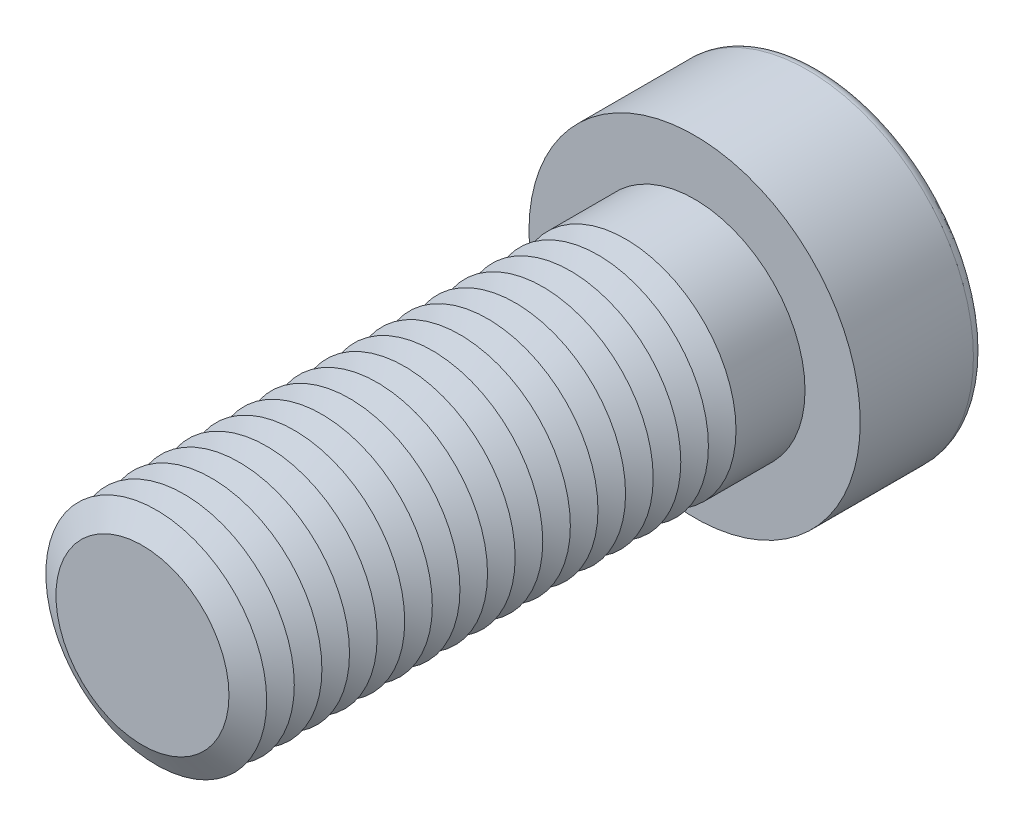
ISO-10303-21;
HEADER;
FILE_DESCRIPTION(('STEP AP214'),'2;1');
FILE_NAME('part.step','',(''),(''),'','','');
FILE_SCHEMA(('AUTOMOTIVE_DESIGN { 1 0 10303 214 1 1 1 1 }'));
ENDSEC;
DATA;
#1=APPLICATION_CONTEXT('core data for automotive mechanical design processes');
#2=APPLICATION_PROTOCOL_DEFINITION('international standard','automotive_design',2000,#1);
#3=PRODUCT_CONTEXT('',#1,'mechanical');
#4=PRODUCT('Part','Part','',(#3));
#5=PRODUCT_RELATED_PRODUCT_CATEGORY('part','',(#4));
#6=PRODUCT_DEFINITION_FORMATION('','',#4);
#7=PRODUCT_DEFINITION_CONTEXT('part definition',#1,'design');
#8=PRODUCT_DEFINITION('design','',#6,#7);
#9=PRODUCT_DEFINITION_SHAPE('','',#8);
#10=(LENGTH_UNIT() NAMED_UNIT(*) SI_UNIT(.MILLI.,.METRE.));
#11=(NAMED_UNIT(*) PLANE_ANGLE_UNIT() SI_UNIT($,.RADIAN.));
#12=(NAMED_UNIT(*) SI_UNIT($,.STERADIAN.) SOLID_ANGLE_UNIT());
#13=UNCERTAINTY_MEASURE_WITH_UNIT(LENGTH_MEASURE(1.E-05),#10,'distance_accuracy_value','');
#14=(GEOMETRIC_REPRESENTATION_CONTEXT(3) GLOBAL_UNCERTAINTY_ASSIGNED_CONTEXT((#13)) GLOBAL_UNIT_ASSIGNED_CONTEXT((#10,
#11,#12)) REPRESENTATION_CONTEXT('',''));
#15=CARTESIAN_POINT('',(0.,0.,0.));
#16=DIRECTION('',(0.,0.,1.));
#17=DIRECTION('',(1.,0.,0.));
#18=AXIS2_PLACEMENT_3D('',#15,#16,#17);
#19=CARTESIAN_POINT('',(0.,0.,33.));
#20=DIRECTION('',(0.,0.,1.));
#21=DIRECTION('',(1.,0.,0.));
#22=AXIS2_PLACEMENT_3D('',#19,#20,#21);
#23=CONICAL_SURFACE('',#22,8.,1.0471975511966);
#24=CARTESIAN_POINT('',(0.,0.,32.));
#25=DIRECTION('',(0.,0.,1.));
#26=DIRECTION('',(1.,0.,0.));
#27=AXIS2_PLACEMENT_3D('',#24,#25,#26);
#28=CIRCLE('',#27,6.26794919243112);
#29=CARTESIAN_POINT('',(6.26794919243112,0.,32.));
#30=VERTEX_POINT('',#29);
#31=EDGE_CURVE('E313',#30,#30,#28,.T.);
#32=ORIENTED_EDGE('',*,*,#31,.T.);
#33=EDGE_LOOP('',(#32));
#34=FACE_BOUND('',#33,.T.);
#35=CARTESIAN_POINT('',(0.,0.,33.));
#36=DIRECTION('',(0.,0.,1.));
#37=DIRECTION('',(1.,0.,0.));
#38=AXIS2_PLACEMENT_3D('',#35,#36,#37);
#39=CIRCLE('',#38,8.);
#40=CARTESIAN_POINT('',(8.,0.,33.));
#41=VERTEX_POINT('',#40);
#42=EDGE_CURVE('E316',#41,#41,#39,.T.);
#43=ORIENTED_EDGE('',*,*,#42,.F.);
#44=EDGE_LOOP('',(#43));
#45=FACE_BOUND('',#44,.T.);
#46=ADVANCED_FACE('F39',(#34,#45),#23,.T.);
#47=CARTESIAN_POINT('',(0.,0.,32.));
#48=DIRECTION('',(0.,0.,-1.));
#49=DIRECTION('',(-1.,0.,0.));
#50=AXIS2_PLACEMENT_3D('',#47,#48,#49);
#51=CONICAL_SURFACE('',#50,6.26794919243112,1.0471975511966);
#52=CARTESIAN_POINT('',(0.,0.,31.));
#53=DIRECTION('',(0.,0.,1.));
#54=DIRECTION('',(1.,0.,0.));
#55=AXIS2_PLACEMENT_3D('',#52,#53,#54);
#56=CIRCLE('',#55,8.);
#57=CARTESIAN_POINT('',(8.,0.,31.));
#58=VERTEX_POINT('',#57);
#59=EDGE_CURVE('E324',#58,#58,#56,.T.);
#60=ORIENTED_EDGE('',*,*,#59,.T.);
#61=EDGE_LOOP('',(#60));
#62=FACE_BOUND('',#61,.T.);
#63=ORIENTED_EDGE('',*,*,#31,.F.);
#64=EDGE_LOOP('',(#63));
#65=FACE_BOUND('',#64,.T.);
#66=ADVANCED_FACE('F245',(#62,#65),#51,.T.);
#67=CARTESIAN_POINT('',(0.,0.,40.));
#68=DIRECTION('',(0.,0.,1.));
#69=DIRECTION('',(1.,0.,0.));
#70=AXIS2_PLACEMENT_3D('',#67,#68,#69);
#71=PLANE('',#70);
#72=CARTESIAN_POINT('',(0.,0.,40.));
#73=DIRECTION('',(0.,0.,1.));
#74=DIRECTION('',(1.,0.,0.));
#75=AXIS2_PLACEMENT_3D('',#72,#73,#74);
#76=CIRCLE('',#75,6.26794919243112);
#77=CARTESIAN_POINT('',(6.26794919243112,0.,40.));
#78=VERTEX_POINT('',#77);
#79=EDGE_CURVE('E174',#78,#78,#76,.T.);
#80=ORIENTED_EDGE('',*,*,#79,.T.);
#81=EDGE_LOOP('',(#80));
#82=FACE_BOUND('',#81,.T.);
#83=ADVANCED_FACE('F251',(#82),#71,.T.);
#84=CARTESIAN_POINT('',(0.,0.,40.));
#85=DIRECTION('',(0.,0.,-1.));
#86=DIRECTION('',(-1.,0.,0.));
#87=AXIS2_PLACEMENT_3D('',#84,#85,#86);
#88=CONICAL_SURFACE('',#87,6.26794919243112,1.0471975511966);
#89=CARTESIAN_POINT('',(0.,0.,39.));
#90=DIRECTION('',(0.,0.,1.));
#91=DIRECTION('',(1.,0.,0.));
#92=AXIS2_PLACEMENT_3D('',#89,#90,#91);
#93=CIRCLE('',#92,8.);
#94=CARTESIAN_POINT('',(8.,0.,39.));
#95=VERTEX_POINT('',#94);
#96=EDGE_CURVE('E291',#95,#95,#93,.T.);
#97=ORIENTED_EDGE('',*,*,#96,.T.);
#98=EDGE_LOOP('',(#97));
#99=FACE_BOUND('',#98,.T.);
#100=ORIENTED_EDGE('',*,*,#79,.F.);
#101=EDGE_LOOP('',(#100));
#102=FACE_BOUND('',#101,.T.);
#103=ADVANCED_FACE('F199',(#99,#102),#88,.T.);
#104=CARTESIAN_POINT('',(0.,0.,39.));
#105=DIRECTION('',(0.,0.,1.));
#106=DIRECTION('',(1.,0.,0.));
#107=AXIS2_PLACEMENT_3D('',#104,#105,#106);
#108=CONICAL_SURFACE('',#107,8.,1.0471975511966);
#109=CARTESIAN_POINT('',(0.,0.,38.));
#110=DIRECTION('',(0.,0.,1.));
#111=DIRECTION('',(1.,0.,0.));
#112=AXIS2_PLACEMENT_3D('',#109,#110,#111);
#113=CIRCLE('',#112,6.26794919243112);
#114=CARTESIAN_POINT('',(6.26794919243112,0.,38.));
#115=VERTEX_POINT('',#114);
#116=EDGE_CURVE('E288',#115,#115,#113,.T.);
#117=ORIENTED_EDGE('',*,*,#116,.T.);
#118=EDGE_LOOP('',(#117));
#119=FACE_BOUND('',#118,.T.);
#120=ORIENTED_EDGE('',*,*,#96,.F.);
#121=EDGE_LOOP('',(#120));
#122=FACE_BOUND('',#121,.T.);
#123=ADVANCED_FACE('F277',(#119,#122),#108,.T.);
#124=CARTESIAN_POINT('',(0.,0.,38.));
#125=DIRECTION('',(0.,0.,-1.));
#126=DIRECTION('',(-1.,0.,0.));
#127=AXIS2_PLACEMENT_3D('',#124,#125,#126);
#128=CONICAL_SURFACE('',#127,6.26794919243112,1.0471975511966);
#129=CARTESIAN_POINT('',(0.,0.,37.));
#130=DIRECTION('',(0.,0.,1.));
#131=DIRECTION('',(1.,0.,0.));
#132=AXIS2_PLACEMENT_3D('',#129,#130,#131);
#133=CIRCLE('',#132,8.);
#134=CARTESIAN_POINT('',(8.,0.,37.));
#135=VERTEX_POINT('',#134);
#136=EDGE_CURVE('E299',#135,#135,#133,.T.);
#137=ORIENTED_EDGE('',*,*,#136,.T.);
#138=EDGE_LOOP('',(#137));
#139=FACE_BOUND('',#138,.T.);
#140=ORIENTED_EDGE('',*,*,#116,.F.);
#141=EDGE_LOOP('',(#140));
#142=FACE_BOUND('',#141,.T.);
#143=ADVANCED_FACE('F274',(#139,#142),#128,.T.);
#144=CARTESIAN_POINT('',(0.,0.,37.));
#145=DIRECTION('',(0.,0.,1.));
#146=DIRECTION('',(1.,0.,0.));
#147=AXIS2_PLACEMENT_3D('',#144,#145,#146);
#148=CONICAL_SURFACE('',#147,8.,1.0471975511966);
#149=CARTESIAN_POINT('',(0.,0.,36.));
#150=DIRECTION('',(0.,0.,1.));
#151=DIRECTION('',(1.,0.,0.));
#152=AXIS2_PLACEMENT_3D('',#149,#150,#151);
#153=CIRCLE('',#152,6.26794919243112);
#154=CARTESIAN_POINT('',(6.26794919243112,0.,36.));
#155=VERTEX_POINT('',#154);
#156=EDGE_CURVE('E293',#155,#155,#153,.T.);
#157=ORIENTED_EDGE('',*,*,#156,.T.);
#158=EDGE_LOOP('',(#157));
#159=FACE_BOUND('',#158,.T.);
#160=ORIENTED_EDGE('',*,*,#136,.F.);
#161=EDGE_LOOP('',(#160));
#162=FACE_BOUND('',#161,.T.);
#163=ADVANCED_FACE('F270',(#159,#162),#148,.T.);
#164=CARTESIAN_POINT('',(0.,0.,36.));
#165=DIRECTION('',(0.,0.,-1.));
#166=DIRECTION('',(-1.,0.,0.));
#167=AXIS2_PLACEMENT_3D('',#164,#165,#166);
#168=CONICAL_SURFACE('',#167,6.26794919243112,1.0471975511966);
#169=CARTESIAN_POINT('',(0.,0.,35.));
#170=DIRECTION('',(0.,0.,1.));
#171=DIRECTION('',(1.,0.,0.));
#172=AXIS2_PLACEMENT_3D('',#169,#170,#171);
#173=CIRCLE('',#172,8.);
#174=CARTESIAN_POINT('',(8.,0.,35.));
#175=VERTEX_POINT('',#174);
#176=EDGE_CURVE('E309',#175,#175,#173,.T.);
#177=ORIENTED_EDGE('',*,*,#176,.T.);
#178=EDGE_LOOP('',(#177));
#179=FACE_BOUND('',#178,.T.);
#180=ORIENTED_EDGE('',*,*,#156,.F.);
#181=EDGE_LOOP('',(#180));
#182=FACE_BOUND('',#181,.T.);
#183=ADVANCED_FACE('F266',(#179,#182),#168,.T.);
#184=CARTESIAN_POINT('',(0.,0.,35.));
#185=DIRECTION('',(0.,0.,1.));
#186=DIRECTION('',(1.,0.,0.));
#187=AXIS2_PLACEMENT_3D('',#184,#185,#186);
#188=CONICAL_SURFACE('',#187,8.,1.0471975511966);
#189=CARTESIAN_POINT('',(0.,0.,34.));
#190=DIRECTION('',(0.,0.,1.));
#191=DIRECTION('',(1.,0.,0.));
#192=AXIS2_PLACEMENT_3D('',#189,#190,#191);
#193=CIRCLE('',#192,6.26794919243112);
#194=CARTESIAN_POINT('',(6.26794919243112,0.,34.));
#195=VERTEX_POINT('',#194);
#196=EDGE_CURVE('E305',#195,#195,#193,.T.);
#197=ORIENTED_EDGE('',*,*,#196,.T.);
#198=EDGE_LOOP('',(#197));
#199=FACE_BOUND('',#198,.T.);
#200=ORIENTED_EDGE('',*,*,#176,.F.);
#201=EDGE_LOOP('',(#200));
#202=FACE_BOUND('',#201,.T.);
#203=ADVANCED_FACE('F262',(#199,#202),#188,.T.);
#204=CARTESIAN_POINT('',(0.,0.,34.));
#205=DIRECTION('',(0.,0.,-1.));
#206=DIRECTION('',(-1.,0.,0.));
#207=AXIS2_PLACEMENT_3D('',#204,#205,#206);
#208=CONICAL_SURFACE('',#207,6.26794919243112,1.0471975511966);
#209=ORIENTED_EDGE('',*,*,#42,.T.);
#210=EDGE_LOOP('',(#209));
#211=FACE_BOUND('',#210,.T.);
#212=ORIENTED_EDGE('',*,*,#196,.F.);
#213=EDGE_LOOP('',(#212));
#214=FACE_BOUND('',#213,.T.);
#215=ADVANCED_FACE('F258',(#211,#214),#208,.T.);
#216=CARTESIAN_POINT('',(0.,0.,31.));
#217=DIRECTION('',(0.,0.,1.));
#218=DIRECTION('',(1.,0.,0.));
#219=AXIS2_PLACEMENT_3D('',#216,#217,#218);
#220=CONICAL_SURFACE('',#219,8.,1.0471975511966);
#221=CARTESIAN_POINT('',(0.,0.,30.));
#222=DIRECTION('',(0.,0.,1.));
#223=DIRECTION('',(1.,0.,0.));
#224=AXIS2_PLACEMENT_3D('',#221,#222,#223);
#225=CIRCLE('',#224,6.26794919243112);
#226=CARTESIAN_POINT('',(6.26794919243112,0.,30.));
#227=VERTEX_POINT('',#226);
#228=EDGE_CURVE('E320',#227,#227,#225,.T.);
#229=ORIENTED_EDGE('',*,*,#228,.T.);
#230=EDGE_LOOP('',(#229));
#231=FACE_BOUND('',#230,.T.);
#232=ORIENTED_EDGE('',*,*,#59,.F.);
#233=EDGE_LOOP('',(#232));
#234=FACE_BOUND('',#233,.T.);
#235=ADVANCED_FACE('F261',(#231,#234),#220,.T.);
#236=CARTESIAN_POINT('',(0.,0.,30.));
#237=DIRECTION('',(0.,0.,-1.));
#238=DIRECTION('',(-1.,0.,0.));
#239=AXIS2_PLACEMENT_3D('',#236,#237,#238);
#240=CONICAL_SURFACE('',#239,6.26794919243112,1.0471975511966);
#241=CARTESIAN_POINT('',(0.,0.,29.));
#242=DIRECTION('',(0.,0.,1.));
#243=DIRECTION('',(1.,0.,0.));
#244=AXIS2_PLACEMENT_3D('',#241,#242,#243);
#245=CIRCLE('',#244,8.);
#246=CARTESIAN_POINT('',(8.,0.,29.));
#247=VERTEX_POINT('',#246);
#248=EDGE_CURVE('E332',#247,#247,#245,.T.);
#249=ORIENTED_EDGE('',*,*,#248,.T.);
#250=EDGE_LOOP('',(#249));
#251=FACE_BOUND('',#250,.T.);
#252=ORIENTED_EDGE('',*,*,#228,.F.);
#253=EDGE_LOOP('',(#252));
#254=FACE_BOUND('',#253,.T.);
#255=ADVANCED_FACE('F527',(#251,#254),#240,.T.);
#256=CARTESIAN_POINT('',(0.,0.,29.));
#257=DIRECTION('',(0.,0.,1.));
#258=DIRECTION('',(1.,0.,0.));
#259=AXIS2_PLACEMENT_3D('',#256,#257,#258);
#260=CONICAL_SURFACE('',#259,8.,1.0471975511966);
#261=CARTESIAN_POINT('',(0.,0.,28.));
#262=DIRECTION('',(0.,0.,1.));
#263=DIRECTION('',(1.,0.,0.));
#264=AXIS2_PLACEMENT_3D('',#261,#262,#263);
#265=CIRCLE('',#264,6.26794919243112);
#266=CARTESIAN_POINT('',(6.26794919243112,0.,28.));
#267=VERTEX_POINT('',#266);
#268=EDGE_CURVE('E328',#267,#267,#265,.T.);
#269=ORIENTED_EDGE('',*,*,#268,.T.);
#270=EDGE_LOOP('',(#269));
#271=FACE_BOUND('',#270,.T.);
#272=ORIENTED_EDGE('',*,*,#248,.F.);
#273=EDGE_LOOP('',(#272));
#274=FACE_BOUND('',#273,.T.);
#275=ADVANCED_FACE('F523',(#271,#274),#260,.T.);
#276=CARTESIAN_POINT('',(0.,0.,28.));
#277=DIRECTION('',(0.,0.,-1.));
#278=DIRECTION('',(-1.,0.,0.));
#279=AXIS2_PLACEMENT_3D('',#276,#277,#278);
#280=CONICAL_SURFACE('',#279,6.26794919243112,1.0471975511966);
#281=CARTESIAN_POINT('',(0.,0.,27.));
#282=DIRECTION('',(0.,0.,1.));
#283=DIRECTION('',(1.,0.,0.));
#284=AXIS2_PLACEMENT_3D('',#281,#282,#283);
#285=CIRCLE('',#284,8.);
#286=CARTESIAN_POINT('',(8.,0.,27.));
#287=VERTEX_POINT('',#286);
#288=EDGE_CURVE('E339',#287,#287,#285,.T.);
#289=ORIENTED_EDGE('',*,*,#288,.T.);
#290=EDGE_LOOP('',(#289));
#291=FACE_BOUND('',#290,.T.);
#292=ORIENTED_EDGE('',*,*,#268,.F.);
#293=EDGE_LOOP('',(#292));
#294=FACE_BOUND('',#293,.T.);
#295=ADVANCED_FACE('F519',(#291,#294),#280,.T.);
#296=CARTESIAN_POINT('',(0.,0.,27.));
#297=DIRECTION('',(0.,0.,1.));
#298=DIRECTION('',(1.,0.,0.));
#299=AXIS2_PLACEMENT_3D('',#296,#297,#298);
#300=CONICAL_SURFACE('',#299,8.,1.0471975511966);
#301=CARTESIAN_POINT('',(0.,0.,26.));
#302=DIRECTION('',(0.,0.,1.));
#303=DIRECTION('',(1.,0.,0.));
#304=AXIS2_PLACEMENT_3D('',#301,#302,#303);
#305=CIRCLE('',#304,6.26794919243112);
#306=CARTESIAN_POINT('',(6.26794919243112,0.,26.));
#307=VERTEX_POINT('',#306);
#308=EDGE_CURVE('E336',#307,#307,#305,.T.);
#309=ORIENTED_EDGE('',*,*,#308,.T.);
#310=EDGE_LOOP('',(#309));
#311=FACE_BOUND('',#310,.T.);
#312=ORIENTED_EDGE('',*,*,#288,.F.);
#313=EDGE_LOOP('',(#312));
#314=FACE_BOUND('',#313,.T.);
#315=ADVANCED_FACE('F515',(#311,#314),#300,.T.);
#316=CARTESIAN_POINT('',(0.,0.,26.));
#317=DIRECTION('',(0.,0.,-1.));
#318=DIRECTION('',(-1.,0.,0.));
#319=AXIS2_PLACEMENT_3D('',#316,#317,#318);
#320=CONICAL_SURFACE('',#319,6.26794919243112,1.0471975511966);
#321=CARTESIAN_POINT('',(0.,0.,25.));
#322=DIRECTION('',(0.,0.,1.));
#323=DIRECTION('',(1.,0.,0.));
#324=AXIS2_PLACEMENT_3D('',#321,#322,#323);
#325=CIRCLE('',#324,8.);
#326=CARTESIAN_POINT('',(8.,0.,25.));
#327=VERTEX_POINT('',#326);
#328=EDGE_CURVE('E347',#327,#327,#325,.T.);
#329=ORIENTED_EDGE('',*,*,#328,.T.);
#330=EDGE_LOOP('',(#329));
#331=FACE_BOUND('',#330,.T.);
#332=ORIENTED_EDGE('',*,*,#308,.F.);
#333=EDGE_LOOP('',(#332));
#334=FACE_BOUND('',#333,.T.);
#335=ADVANCED_FACE('F511',(#331,#334),#320,.T.);
#336=CARTESIAN_POINT('',(0.,0.,25.));
#337=DIRECTION('',(0.,0.,1.));
#338=DIRECTION('',(1.,0.,0.));
#339=AXIS2_PLACEMENT_3D('',#336,#337,#338);
#340=CONICAL_SURFACE('',#339,8.,1.0471975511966);
#341=CARTESIAN_POINT('',(0.,0.,24.));
#342=DIRECTION('',(0.,0.,1.));
#343=DIRECTION('',(1.,0.,0.));
#344=AXIS2_PLACEMENT_3D('',#341,#342,#343);
#345=CIRCLE('',#344,6.26794919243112);
#346=CARTESIAN_POINT('',(6.26794919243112,0.,24.));
#347=VERTEX_POINT('',#346);
#348=EDGE_CURVE('E343',#347,#347,#345,.T.);
#349=ORIENTED_EDGE('',*,*,#348,.T.);
#350=EDGE_LOOP('',(#349));
#351=FACE_BOUND('',#350,.T.);
#352=ORIENTED_EDGE('',*,*,#328,.F.);
#353=EDGE_LOOP('',(#352));
#354=FACE_BOUND('',#353,.T.);
#355=ADVANCED_FACE('F507',(#351,#354),#340,.T.);
#356=CARTESIAN_POINT('',(0.,0.,24.));
#357=DIRECTION('',(0.,0.,-1.));
#358=DIRECTION('',(-1.,0.,0.));
#359=AXIS2_PLACEMENT_3D('',#356,#357,#358);
#360=CONICAL_SURFACE('',#359,6.26794919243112,1.0471975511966);
#361=CARTESIAN_POINT('',(0.,0.,23.));
#362=DIRECTION('',(0.,0.,1.));
#363=DIRECTION('',(1.,0.,0.));
#364=AXIS2_PLACEMENT_3D('',#361,#362,#363);
#365=CIRCLE('',#364,8.);
#366=CARTESIAN_POINT('',(8.,0.,23.));
#367=VERTEX_POINT('',#366);
#368=EDGE_CURVE('E355',#367,#367,#365,.T.);
#369=ORIENTED_EDGE('',*,*,#368,.T.);
#370=EDGE_LOOP('',(#369));
#371=FACE_BOUND('',#370,.T.);
#372=ORIENTED_EDGE('',*,*,#348,.F.);
#373=EDGE_LOOP('',(#372));
#374=FACE_BOUND('',#373,.T.);
#375=ADVANCED_FACE('F503',(#371,#374),#360,.T.);
#376=CARTESIAN_POINT('',(0.,0.,23.));
#377=DIRECTION('',(0.,0.,1.));
#378=DIRECTION('',(1.,0.,0.));
#379=AXIS2_PLACEMENT_3D('',#376,#377,#378);
#380=CONICAL_SURFACE('',#379,8.,1.0471975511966);
#381=CARTESIAN_POINT('',(0.,0.,22.));
#382=DIRECTION('',(0.,0.,1.));
#383=DIRECTION('',(1.,0.,0.));
#384=AXIS2_PLACEMENT_3D('',#381,#382,#383);
#385=CIRCLE('',#384,6.26794919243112);
#386=CARTESIAN_POINT('',(6.26794919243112,0.,22.));
#387=VERTEX_POINT('',#386);
#388=EDGE_CURVE('E351',#387,#387,#385,.T.);
#389=ORIENTED_EDGE('',*,*,#388,.T.);
#390=EDGE_LOOP('',(#389));
#391=FACE_BOUND('',#390,.T.);
#392=ORIENTED_EDGE('',*,*,#368,.F.);
#393=EDGE_LOOP('',(#392));
#394=FACE_BOUND('',#393,.T.);
#395=ADVANCED_FACE('F499',(#391,#394),#380,.T.);
#396=CARTESIAN_POINT('',(0.,0.,22.));
#397=DIRECTION('',(0.,0.,-1.));
#398=DIRECTION('',(-1.,0.,0.));
#399=AXIS2_PLACEMENT_3D('',#396,#397,#398);
#400=CONICAL_SURFACE('',#399,6.26794919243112,1.0471975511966);
#401=CARTESIAN_POINT('',(0.,0.,21.));
#402=DIRECTION('',(0.,0.,1.));
#403=DIRECTION('',(1.,0.,0.));
#404=AXIS2_PLACEMENT_3D('',#401,#402,#403);
#405=CIRCLE('',#404,8.);
#406=CARTESIAN_POINT('',(8.,0.,21.));
#407=VERTEX_POINT('',#406);
#408=EDGE_CURVE('E363',#407,#407,#405,.T.);
#409=ORIENTED_EDGE('',*,*,#408,.T.);
#410=EDGE_LOOP('',(#409));
#411=FACE_BOUND('',#410,.T.);
#412=ORIENTED_EDGE('',*,*,#388,.F.);
#413=EDGE_LOOP('',(#412));
#414=FACE_BOUND('',#413,.T.);
#415=ADVANCED_FACE('F495',(#411,#414),#400,.T.);
#416=CARTESIAN_POINT('',(0.,0.,21.));
#417=DIRECTION('',(0.,0.,1.));
#418=DIRECTION('',(1.,0.,0.));
#419=AXIS2_PLACEMENT_3D('',#416,#417,#418);
#420=CONICAL_SURFACE('',#419,8.,1.0471975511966);
#421=CARTESIAN_POINT('',(0.,0.,20.));
#422=DIRECTION('',(0.,0.,1.));
#423=DIRECTION('',(1.,0.,0.));
#424=AXIS2_PLACEMENT_3D('',#421,#422,#423);
#425=CIRCLE('',#424,6.26794919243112);
#426=CARTESIAN_POINT('',(6.26794919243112,0.,20.));
#427=VERTEX_POINT('',#426);
#428=EDGE_CURVE('E359',#427,#427,#425,.T.);
#429=ORIENTED_EDGE('',*,*,#428,.T.);
#430=EDGE_LOOP('',(#429));
#431=FACE_BOUND('',#430,.T.);
#432=ORIENTED_EDGE('',*,*,#408,.F.);
#433=EDGE_LOOP('',(#432));
#434=FACE_BOUND('',#433,.T.);
#435=ADVANCED_FACE('F491',(#431,#434),#420,.T.);
#436=CARTESIAN_POINT('',(0.,0.,20.));
#437=DIRECTION('',(0.,0.,-1.));
#438=DIRECTION('',(-1.,0.,0.));
#439=AXIS2_PLACEMENT_3D('',#436,#437,#438);
#440=CONICAL_SURFACE('',#439,6.26794919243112,1.0471975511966);
#441=CARTESIAN_POINT('',(0.,0.,19.));
#442=DIRECTION('',(0.,0.,1.));
#443=DIRECTION('',(1.,0.,0.));
#444=AXIS2_PLACEMENT_3D('',#441,#442,#443);
#445=CIRCLE('',#444,8.);
#446=CARTESIAN_POINT('',(8.,0.,19.));
#447=VERTEX_POINT('',#446);
#448=EDGE_CURVE('E371',#447,#447,#445,.T.);
#449=ORIENTED_EDGE('',*,*,#448,.T.);
#450=EDGE_LOOP('',(#449));
#451=FACE_BOUND('',#450,.T.);
#452=ORIENTED_EDGE('',*,*,#428,.F.);
#453=EDGE_LOOP('',(#452));
#454=FACE_BOUND('',#453,.T.);
#455=ADVANCED_FACE('F487',(#451,#454),#440,.T.);
#456=CARTESIAN_POINT('',(0.,0.,19.));
#457=DIRECTION('',(0.,0.,1.));
#458=DIRECTION('',(1.,0.,0.));
#459=AXIS2_PLACEMENT_3D('',#456,#457,#458);
#460=CONICAL_SURFACE('',#459,8.,1.0471975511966);
#461=CARTESIAN_POINT('',(0.,0.,18.));
#462=DIRECTION('',(0.,0.,1.));
#463=DIRECTION('',(1.,0.,0.));
#464=AXIS2_PLACEMENT_3D('',#461,#462,#463);
#465=CIRCLE('',#464,6.26794919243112);
#466=CARTESIAN_POINT('',(6.26794919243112,0.,18.));
#467=VERTEX_POINT('',#466);
#468=EDGE_CURVE('E367',#467,#467,#465,.T.);
#469=ORIENTED_EDGE('',*,*,#468,.T.);
#470=EDGE_LOOP('',(#469));
#471=FACE_BOUND('',#470,.T.);
#472=ORIENTED_EDGE('',*,*,#448,.F.);
#473=EDGE_LOOP('',(#472));
#474=FACE_BOUND('',#473,.T.);
#475=ADVANCED_FACE('F483',(#471,#474),#460,.T.);
#476=CARTESIAN_POINT('',(0.,0.,18.));
#477=DIRECTION('',(0.,0.,-1.));
#478=DIRECTION('',(-1.,0.,0.));
#479=AXIS2_PLACEMENT_3D('',#476,#477,#478);
#480=CONICAL_SURFACE('',#479,6.26794919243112,1.0471975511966);
#481=CARTESIAN_POINT('',(0.,0.,17.));
#482=DIRECTION('',(0.,0.,1.));
#483=DIRECTION('',(1.,0.,0.));
#484=AXIS2_PLACEMENT_3D('',#481,#482,#483);
#485=CIRCLE('',#484,8.);
#486=CARTESIAN_POINT('',(8.,0.,17.));
#487=VERTEX_POINT('',#486);
#488=EDGE_CURVE('E379',#487,#487,#485,.T.);
#489=ORIENTED_EDGE('',*,*,#488,.T.);
#490=EDGE_LOOP('',(#489));
#491=FACE_BOUND('',#490,.T.);
#492=ORIENTED_EDGE('',*,*,#468,.F.);
#493=EDGE_LOOP('',(#492));
#494=FACE_BOUND('',#493,.T.);
#495=ADVANCED_FACE('F479',(#491,#494),#480,.T.);
#496=CARTESIAN_POINT('',(0.,0.,17.));
#497=DIRECTION('',(0.,0.,1.));
#498=DIRECTION('',(1.,0.,0.));
#499=AXIS2_PLACEMENT_3D('',#496,#497,#498);
#500=CONICAL_SURFACE('',#499,8.,1.0471975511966);
#501=CARTESIAN_POINT('',(0.,0.,16.));
#502=DIRECTION('',(0.,0.,1.));
#503=DIRECTION('',(1.,0.,0.));
#504=AXIS2_PLACEMENT_3D('',#501,#502,#503);
#505=CIRCLE('',#504,6.26794919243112);
#506=CARTESIAN_POINT('',(6.26794919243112,0.,16.));
#507=VERTEX_POINT('',#506);
#508=EDGE_CURVE('E375',#507,#507,#505,.T.);
#509=ORIENTED_EDGE('',*,*,#508,.T.);
#510=EDGE_LOOP('',(#509));
#511=FACE_BOUND('',#510,.T.);
#512=ORIENTED_EDGE('',*,*,#488,.F.);
#513=EDGE_LOOP('',(#512));
#514=FACE_BOUND('',#513,.T.);
#515=ADVANCED_FACE('F475',(#511,#514),#500,.T.);
#516=CARTESIAN_POINT('',(0.,0.,16.));
#517=DIRECTION('',(0.,0.,-1.));
#518=DIRECTION('',(-1.,0.,0.));
#519=AXIS2_PLACEMENT_3D('',#516,#517,#518);
#520=CONICAL_SURFACE('',#519,6.26794919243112,1.0471975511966);
#521=CARTESIAN_POINT('',(0.,0.,15.));
#522=DIRECTION('',(0.,0.,1.));
#523=DIRECTION('',(1.,0.,0.));
#524=AXIS2_PLACEMENT_3D('',#521,#522,#523);
#525=CIRCLE('',#524,8.);
#526=CARTESIAN_POINT('',(8.,0.,15.));
#527=VERTEX_POINT('',#526);
#528=EDGE_CURVE('E387',#527,#527,#525,.T.);
#529=ORIENTED_EDGE('',*,*,#528,.T.);
#530=EDGE_LOOP('',(#529));
#531=FACE_BOUND('',#530,.T.);
#532=ORIENTED_EDGE('',*,*,#508,.F.);
#533=EDGE_LOOP('',(#532));
#534=FACE_BOUND('',#533,.T.);
#535=ADVANCED_FACE('F471',(#531,#534),#520,.T.);
#536=CARTESIAN_POINT('',(0.,0.,15.));
#537=DIRECTION('',(0.,0.,1.));
#538=DIRECTION('',(1.,0.,0.));
#539=AXIS2_PLACEMENT_3D('',#536,#537,#538);
#540=CONICAL_SURFACE('',#539,8.,1.0471975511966);
#541=CARTESIAN_POINT('',(0.,0.,14.));
#542=DIRECTION('',(0.,0.,1.));
#543=DIRECTION('',(1.,0.,0.));
#544=AXIS2_PLACEMENT_3D('',#541,#542,#543);
#545=CIRCLE('',#544,6.26794919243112);
#546=CARTESIAN_POINT('',(6.26794919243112,0.,14.));
#547=VERTEX_POINT('',#546);
#548=EDGE_CURVE('E383',#547,#547,#545,.T.);
#549=ORIENTED_EDGE('',*,*,#548,.T.);
#550=EDGE_LOOP('',(#549));
#551=FACE_BOUND('',#550,.T.);
#552=ORIENTED_EDGE('',*,*,#528,.F.);
#553=EDGE_LOOP('',(#552));
#554=FACE_BOUND('',#553,.T.);
#555=ADVANCED_FACE('F467',(#551,#554),#540,.T.);
#556=CARTESIAN_POINT('',(0.,0.,14.));
#557=DIRECTION('',(0.,0.,-1.));
#558=DIRECTION('',(-1.,0.,0.));
#559=AXIS2_PLACEMENT_3D('',#556,#557,#558);
#560=CONICAL_SURFACE('',#559,6.26794919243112,1.0471975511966);
#561=CARTESIAN_POINT('',(0.,0.,13.));
#562=DIRECTION('',(0.,0.,1.));
#563=DIRECTION('',(1.,0.,0.));
#564=AXIS2_PLACEMENT_3D('',#561,#562,#563);
#565=CIRCLE('',#564,8.);
#566=CARTESIAN_POINT('',(8.,0.,13.));
#567=VERTEX_POINT('',#566);
#568=EDGE_CURVE('E395',#567,#567,#565,.T.);
#569=ORIENTED_EDGE('',*,*,#568,.T.);
#570=EDGE_LOOP('',(#569));
#571=FACE_BOUND('',#570,.T.);
#572=ORIENTED_EDGE('',*,*,#548,.F.);
#573=EDGE_LOOP('',(#572));
#574=FACE_BOUND('',#573,.T.);
#575=ADVANCED_FACE('F463',(#571,#574),#560,.T.);
#576=CARTESIAN_POINT('',(0.,0.,13.));
#577=DIRECTION('',(0.,0.,1.));
#578=DIRECTION('',(1.,0.,0.));
#579=AXIS2_PLACEMENT_3D('',#576,#577,#578);
#580=CONICAL_SURFACE('',#579,8.,1.0471975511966);
#581=CARTESIAN_POINT('',(0.,0.,12.));
#582=DIRECTION('',(0.,0.,1.));
#583=DIRECTION('',(1.,0.,0.));
#584=AXIS2_PLACEMENT_3D('',#581,#582,#583);
#585=CIRCLE('',#584,6.26794919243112);
#586=CARTESIAN_POINT('',(6.26794919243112,0.,12.));
#587=VERTEX_POINT('',#586);
#588=EDGE_CURVE('E391',#587,#587,#585,.T.);
#589=ORIENTED_EDGE('',*,*,#588,.T.);
#590=EDGE_LOOP('',(#589));
#591=FACE_BOUND('',#590,.T.);
#592=ORIENTED_EDGE('',*,*,#568,.F.);
#593=EDGE_LOOP('',(#592));
#594=FACE_BOUND('',#593,.T.);
#595=ADVANCED_FACE('F459',(#591,#594),#580,.T.);
#596=CARTESIAN_POINT('',(0.,0.,12.));
#597=DIRECTION('',(0.,0.,-1.));
#598=DIRECTION('',(-1.,0.,0.));
#599=AXIS2_PLACEMENT_3D('',#596,#597,#598);
#600=CONICAL_SURFACE('',#599,6.26794919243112,1.0471975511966);
#601=CARTESIAN_POINT('',(0.,0.,11.));
#602=DIRECTION('',(0.,0.,1.));
#603=DIRECTION('',(1.,0.,0.));
#604=AXIS2_PLACEMENT_3D('',#601,#602,#603);
#605=CIRCLE('',#604,8.);
#606=CARTESIAN_POINT('',(8.,0.,11.));
#607=VERTEX_POINT('',#606);
#608=EDGE_CURVE('E403',#607,#607,#605,.T.);
#609=ORIENTED_EDGE('',*,*,#608,.T.);
#610=EDGE_LOOP('',(#609));
#611=FACE_BOUND('',#610,.T.);
#612=ORIENTED_EDGE('',*,*,#588,.F.);
#613=EDGE_LOOP('',(#612));
#614=FACE_BOUND('',#613,.T.);
#615=ADVANCED_FACE('F455',(#611,#614),#600,.T.);
#616=CARTESIAN_POINT('',(0.,0.,11.));
#617=DIRECTION('',(0.,0.,1.));
#618=DIRECTION('',(1.,0.,0.));
#619=AXIS2_PLACEMENT_3D('',#616,#617,#618);
#620=CONICAL_SURFACE('',#619,8.,1.0471975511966);
#621=CARTESIAN_POINT('',(0.,0.,10.));
#622=DIRECTION('',(0.,0.,1.));
#623=DIRECTION('',(1.,0.,0.));
#624=AXIS2_PLACEMENT_3D('',#621,#622,#623);
#625=CIRCLE('',#624,6.26794919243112);
#626=CARTESIAN_POINT('',(6.26794919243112,0.,10.));
#627=VERTEX_POINT('',#626);
#628=EDGE_CURVE('E399',#627,#627,#625,.T.);
#629=ORIENTED_EDGE('',*,*,#628,.T.);
#630=EDGE_LOOP('',(#629));
#631=FACE_BOUND('',#630,.T.);
#632=ORIENTED_EDGE('',*,*,#608,.F.);
#633=EDGE_LOOP('',(#632));
#634=FACE_BOUND('',#633,.T.);
#635=ADVANCED_FACE('F451',(#631,#634),#620,.T.);
#636=CARTESIAN_POINT('',(0.,0.,10.));
#637=DIRECTION('',(0.,0.,-1.));
#638=DIRECTION('',(-1.,0.,0.));
#639=AXIS2_PLACEMENT_3D('',#636,#637,#638);
#640=CONICAL_SURFACE('',#639,6.26794919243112,1.0471975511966);
#641=CARTESIAN_POINT('',(0.,0.,9.));
#642=DIRECTION('',(0.,0.,1.));
#643=DIRECTION('',(1.,0.,0.));
#644=AXIS2_PLACEMENT_3D('',#641,#642,#643);
#645=CIRCLE('',#644,8.);
#646=CARTESIAN_POINT('',(8.,0.,9.));
#647=VERTEX_POINT('',#646);
#648=EDGE_CURVE('E411',#647,#647,#645,.T.);
#649=ORIENTED_EDGE('',*,*,#648,.T.);
#650=EDGE_LOOP('',(#649));
#651=FACE_BOUND('',#650,.T.);
#652=ORIENTED_EDGE('',*,*,#628,.F.);
#653=EDGE_LOOP('',(#652));
#654=FACE_BOUND('',#653,.T.);
#655=ADVANCED_FACE('F447',(#651,#654),#640,.T.);
#656=CARTESIAN_POINT('',(0.,0.,9.));
#657=DIRECTION('',(0.,0.,1.));
#658=DIRECTION('',(1.,0.,0.));
#659=AXIS2_PLACEMENT_3D('',#656,#657,#658);
#660=CONICAL_SURFACE('',#659,8.,1.0471975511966);
#661=CARTESIAN_POINT('',(0.,0.,8.));
#662=DIRECTION('',(0.,0.,1.));
#663=DIRECTION('',(1.,0.,0.));
#664=AXIS2_PLACEMENT_3D('',#661,#662,#663);
#665=CIRCLE('',#664,6.26794919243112);
#666=CARTESIAN_POINT('',(6.26794919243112,0.,8.));
#667=VERTEX_POINT('',#666);
#668=EDGE_CURVE('E407',#667,#667,#665,.T.);
#669=ORIENTED_EDGE('',*,*,#668,.T.);
#670=EDGE_LOOP('',(#669));
#671=FACE_BOUND('',#670,.T.);
#672=ORIENTED_EDGE('',*,*,#648,.F.);
#673=EDGE_LOOP('',(#672));
#674=FACE_BOUND('',#673,.T.);
#675=ADVANCED_FACE('F442',(#671,#674),#660,.T.);
#676=CARTESIAN_POINT('',(0.,0.,8.));
#677=DIRECTION('',(0.,0.,-1.));
#678=DIRECTION('',(-1.,0.,0.));
#679=AXIS2_PLACEMENT_3D('',#676,#677,#678);
#680=CONICAL_SURFACE('',#679,6.26794919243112,1.0471975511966);
#681=CARTESIAN_POINT('',(0.,0.,7.));
#682=DIRECTION('',(0.,0.,1.));
#683=DIRECTION('',(1.,0.,0.));
#684=AXIS2_PLACEMENT_3D('',#681,#682,#683);
#685=CIRCLE('',#684,8.);
#686=CARTESIAN_POINT('',(8.,0.,7.));
#687=VERTEX_POINT('',#686);
#688=EDGE_CURVE('E423',#687,#687,#685,.T.);
#689=ORIENTED_EDGE('',*,*,#688,.T.);
#690=EDGE_LOOP('',(#689));
#691=FACE_BOUND('',#690,.T.);
#692=ORIENTED_EDGE('',*,*,#668,.F.);
#693=EDGE_LOOP('',(#692));
#694=FACE_BOUND('',#693,.T.);
#695=ADVANCED_FACE('F428',(#691,#694),#680,.T.);
#696=CARTESIAN_POINT('',(0.,0.,7.));
#697=DIRECTION('',(0.,0.,1.));
#698=DIRECTION('',(1.,0.,0.));
#699=AXIS2_PLACEMENT_3D('',#696,#697,#698);
#700=CONICAL_SURFACE('',#699,8.,1.0471975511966);
#701=CARTESIAN_POINT('',(0.,0.,6.));
#702=DIRECTION('',(0.,0.,1.));
#703=DIRECTION('',(1.,0.,0.));
#704=AXIS2_PLACEMENT_3D('',#701,#702,#703);
#705=CIRCLE('',#704,6.26794919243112);
#706=CARTESIAN_POINT('',(6.26794919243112,0.,6.));
#707=VERTEX_POINT('',#706);
#708=EDGE_CURVE('E415',#707,#707,#705,.T.);
#709=ORIENTED_EDGE('',*,*,#708,.T.);
#710=EDGE_LOOP('',(#709));
#711=FACE_BOUND('',#710,.T.);
#712=ORIENTED_EDGE('',*,*,#688,.F.);
#713=EDGE_LOOP('',(#712));
#714=FACE_BOUND('',#713,.T.);
#715=ADVANCED_FACE('F431',(#711,#714),#700,.T.);
#716=CARTESIAN_POINT('',(0.,0.,6.));
#717=DIRECTION('',(0.,0.,-1.));
#718=DIRECTION('',(-1.,0.,0.));
#719=AXIS2_PLACEMENT_3D('',#716,#717,#718);
#720=CONICAL_SURFACE('',#719,6.26794919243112,1.0471975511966);
#721=CARTESIAN_POINT('',(0.,0.,5.));
#722=DIRECTION('',(0.,0.,1.));
#723=DIRECTION('',(1.,0.,0.));
#724=AXIS2_PLACEMENT_3D('',#721,#722,#723);
#725=CIRCLE('',#724,8.);
#726=CARTESIAN_POINT('',(8.,0.,5.));
#727=VERTEX_POINT('',#726);
#728=EDGE_CURVE('E419',#727,#727,#725,.T.);
#729=ORIENTED_EDGE('',*,*,#728,.T.);
#730=EDGE_LOOP('',(#729));
#731=FACE_BOUND('',#730,.T.);
#732=ORIENTED_EDGE('',*,*,#708,.F.);
#733=EDGE_LOOP('',(#732));
#734=FACE_BOUND('',#733,.T.);
#735=ADVANCED_FACE('F433',(#731,#734),#720,.T.);
#736=CARTESIAN_POINT('',(0.,0.,0.));
#737=DIRECTION('',(0.,0.,-1.));
#738=DIRECTION('',(-1.,0.,0.));
#739=AXIS2_PLACEMENT_3D('',#736,#737,#738);
#740=CONICAL_SURFACE('',#739,6.,1.0471975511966);
#741=CARTESIAN_POINT('',(0.,0.,3.46410161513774));
#742=VERTEX_POINT('',#741);
#743=VERTEX_LOOP('',#742);
#744=FACE_BOUND('',#743,.T.);
#745=CARTESIAN_POINT('',(0.,0.,0.));
#746=DIRECTION('',(0.,0.,-1.));
#747=DIRECTION('',(-1.,0.,0.));
#748=AXIS2_PLACEMENT_3D('',#745,#746,#747);
#749=CIRCLE('',#748,6.);
#750=CARTESIAN_POINT('',(-5.19615242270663,3.,0.));
#751=VERTEX_POINT('',#750);
#752=CARTESIAN_POINT('',(0.,6.,0.));
#753=VERTEX_POINT('',#752);
#754=EDGE_CURVE('E149',#751,#753,#749,.T.);
#755=ORIENTED_EDGE('',*,*,#754,.T.);
#756=CARTESIAN_POINT('',(0.,0.,0.));
#757=DIRECTION('',(0.,0.,-1.));
#758=DIRECTION('',(-1.,0.,0.));
#759=AXIS2_PLACEMENT_3D('',#756,#757,#758);
#760=CIRCLE('',#759,6.);
#761=CARTESIAN_POINT('',(5.19615242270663,3.,0.));
#762=VERTEX_POINT('',#761);
#763=EDGE_CURVE('E54',#753,#762,#760,.T.);
#764=ORIENTED_EDGE('',*,*,#763,.T.);
#765=CARTESIAN_POINT('',(5.19615242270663,-3.,0.));
#766=VERTEX_POINT('',#765);
#767=EDGE_CURVE('E1056',#762,#766,#760,.T.);
#768=ORIENTED_EDGE('',*,*,#767,.T.);
#769=CARTESIAN_POINT('',(0.,-6.,0.));
#770=VERTEX_POINT('',#769);
#771=EDGE_CURVE('E1054',#766,#770,#760,.T.);
#772=ORIENTED_EDGE('',*,*,#771,.T.);
#773=CARTESIAN_POINT('',(-5.19615242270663,-3.,0.));
#774=VERTEX_POINT('',#773);
#775=EDGE_CURVE('E1049',#770,#774,#760,.T.);
#776=ORIENTED_EDGE('',*,*,#775,.T.);
#777=EDGE_CURVE('E1047',#774,#751,#760,.T.);
#778=ORIENTED_EDGE('',*,*,#777,.T.);
#779=EDGE_LOOP('',(#755,#764,#768,#772,#776,#778));
#780=FACE_BOUND('',#779,.T.);
#781=ADVANCED_FACE('F201',(#744,#780),#740,.F.);
#782=CARTESIAN_POINT('',(0.,0.,0.));
#783=DIRECTION('',(0.,0.,-1.));
#784=DIRECTION('',(-1.,0.,0.));
#785=AXIS2_PLACEMENT_3D('',#782,#783,#784);
#786=PLANE('',#785);
#787=ORIENTED_EDGE('',*,*,#763,.F.);
#788=DIRECTION('',(1.,0.,0.));
#789=VECTOR('',#788,1.);
#790=CARTESIAN_POINT('',(-3.46410161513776,6.,0.));
#791=LINE('',#790,#789);
#792=CARTESIAN_POINT('',(3.46410161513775,6.,0.));
#793=VERTEX_POINT('',#792);
#794=EDGE_CURVE('E1098',#753,#793,#791,.T.);
#795=ORIENTED_EDGE('',*,*,#794,.T.);
#796=DIRECTION('',(0.5,-0.866025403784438,0.));
#797=VECTOR('',#796,1.);
#798=CARTESIAN_POINT('',(3.46410161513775,6.,0.));
#799=LINE('',#798,#797);
#800=EDGE_CURVE('E155',#793,#762,#799,.T.);
#801=ORIENTED_EDGE('',*,*,#800,.T.);
#802=EDGE_LOOP('',(#787,#795,#801));
#803=FACE_BOUND('',#802,.T.);
#804=ADVANCED_FACE('F628',(#803),#786,.T.);
#805=ORIENTED_EDGE('',*,*,#767,.F.);
#806=CARTESIAN_POINT('',(6.92820323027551,0.,0.));
#807=VERTEX_POINT('',#806);
#808=EDGE_CURVE('E1093',#762,#807,#799,.T.);
#809=ORIENTED_EDGE('',*,*,#808,.T.);
#810=DIRECTION('',(-0.5,-0.866025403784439,0.));
#811=VECTOR('',#810,1.);
#812=CARTESIAN_POINT('',(6.92820323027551,0.,0.));
#813=LINE('',#812,#811);
#814=EDGE_CURVE('E1069',#807,#766,#813,.T.);
#815=ORIENTED_EDGE('',*,*,#814,.T.);
#816=EDGE_LOOP('',(#805,#809,#815));
#817=FACE_BOUND('',#816,.T.);
#818=ADVANCED_FACE('F638',(#817),#786,.T.);
#819=ORIENTED_EDGE('',*,*,#771,.F.);
#820=CARTESIAN_POINT('',(3.46410161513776,-6.,0.));
#821=VERTEX_POINT('',#820);
#822=EDGE_CURVE('E1071',#766,#821,#813,.T.);
#823=ORIENTED_EDGE('',*,*,#822,.T.);
#824=DIRECTION('',(-1.,0.,0.));
#825=VECTOR('',#824,1.);
#826=CARTESIAN_POINT('',(3.46410161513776,-6.,0.));
#827=LINE('',#826,#825);
#828=EDGE_CURVE('E1022',#821,#770,#827,.T.);
#829=ORIENTED_EDGE('',*,*,#828,.T.);
#830=EDGE_LOOP('',(#819,#823,#829));
#831=FACE_BOUND('',#830,.T.);
#832=ADVANCED_FACE('F648',(#831),#786,.T.);
#833=ORIENTED_EDGE('',*,*,#775,.F.);
#834=CARTESIAN_POINT('',(-3.46410161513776,-6.,0.));
#835=VERTEX_POINT('',#834);
#836=EDGE_CURVE('E1065',#770,#835,#827,.T.);
#837=ORIENTED_EDGE('',*,*,#836,.T.);
#838=DIRECTION('',(-0.5,0.866025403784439,0.));
#839=VECTOR('',#838,1.);
#840=CARTESIAN_POINT('',(-3.46410161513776,-6.,0.));
#841=LINE('',#840,#839);
#842=EDGE_CURVE('E1067',#835,#774,#841,.T.);
#843=ORIENTED_EDGE('',*,*,#842,.T.);
#844=EDGE_LOOP('',(#833,#837,#843));
#845=FACE_BOUND('',#844,.T.);
#846=ADVANCED_FACE('F656',(#845),#786,.T.);
#847=ORIENTED_EDGE('',*,*,#777,.F.);
#848=CARTESIAN_POINT('',(-6.92820323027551,0.,0.));
#849=VERTEX_POINT('',#848);
#850=EDGE_CURVE('E1073',#774,#849,#841,.T.);
#851=ORIENTED_EDGE('',*,*,#850,.T.);
#852=DIRECTION('',(0.5,0.866025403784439,0.));
#853=VECTOR('',#852,1.);
#854=CARTESIAN_POINT('',(-6.92820323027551,0.,0.));
#855=LINE('',#854,#853);
#856=EDGE_CURVE('E158',#849,#751,#855,.T.);
#857=ORIENTED_EDGE('',*,*,#856,.T.);
#858=EDGE_LOOP('',(#847,#851,#857));
#859=FACE_BOUND('',#858,.T.);
#860=ADVANCED_FACE('F231',(#859),#786,.T.);
#861=ORIENTED_EDGE('',*,*,#754,.F.);
#862=CARTESIAN_POINT('',(-3.46410161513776,6.,0.));
#863=VERTEX_POINT('',#862);
#864=EDGE_CURVE('E1080',#751,#863,#855,.T.);
#865=ORIENTED_EDGE('',*,*,#864,.T.);
#866=EDGE_CURVE('E1095',#863,#753,#791,.T.);
#867=ORIENTED_EDGE('',*,*,#866,.T.);
#868=EDGE_LOOP('',(#861,#865,#867));
#869=FACE_BOUND('',#868,.T.);
#870=ADVANCED_FACE('F640',(#869),#786,.T.);
#871=CARTESIAN_POINT('',(-3.46410161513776,6.,0.));
#872=DIRECTION('',(0.,1.,0.));
#873=DIRECTION('',(0.,0.,1.));
#874=AXIS2_PLACEMENT_3D('',#871,#872,#873);
#875=PLANE('',#874);
#876=DIRECTION('',(0.,0.,-1.));
#877=VECTOR('',#876,1.);
#878=CARTESIAN_POINT('',(-3.46410161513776,6.,0.));
#879=LINE('',#878,#877);
#880=CARTESIAN_POINT('',(-3.46410161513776,6.,-9.));
#881=VERTEX_POINT('',#880);
#882=EDGE_CURVE('E147',#863,#881,#879,.T.);
#883=ORIENTED_EDGE('',*,*,#882,.T.);
#884=CARTESIAN_POINT('',(-9.04322275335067,6.,-10.0515506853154));
#885=CARTESIAN_POINT('',(-8.77229389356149,6.,-9.99107568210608));
#886=CARTESIAN_POINT('',(-8.50119215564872,6.,-9.93136093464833));
#887=CARTESIAN_POINT('',(-7.95855825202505,6.,-9.81386229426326));
#888=CARTESIAN_POINT('',(-7.68702606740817,6.,-9.75607848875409));
#889=CARTESIAN_POINT('',(-7.14318995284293,6.,-9.64279905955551));
#890=CARTESIAN_POINT('',(-6.87088551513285,6.,-9.58730586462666));
#891=CARTESIAN_POINT('',(-6.32570082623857,6.,-9.47922577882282));
#892=CARTESIAN_POINT('',(-6.05282058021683,6.,-9.42663886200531));
#893=CARTESIAN_POINT('',(-5.50875458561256,6.,-9.32550177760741));
#894=CARTESIAN_POINT('',(-5.23757463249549,6.,-9.27692059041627));
#895=CARTESIAN_POINT('',(-4.69446863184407,6.,-9.18413302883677));
#896=CARTESIAN_POINT('',(-4.42254260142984,6.,-9.13992655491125));
#897=CARTESIAN_POINT('',(-3.87790333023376,6.,-9.05690830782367));
#898=CARTESIAN_POINT('',(-3.6051902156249,6.,-9.0180957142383));
#899=CARTESIAN_POINT('',(-3.05890080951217,6.,-8.94703062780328));
#900=CARTESIAN_POINT('',(-2.7853245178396,6.,-8.91477813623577));
#901=CARTESIAN_POINT('',(-2.23425545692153,6.,-8.85776959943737));
#902=CARTESIAN_POINT('',(-1.95675335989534,6.,-8.83310236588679));
#903=CARTESIAN_POINT('',(-1.40107824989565,6.,-8.79298360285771));
#904=CARTESIAN_POINT('',(-1.12290525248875,6.,-8.77753186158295));
#905=CARTESIAN_POINT('',(-0.566293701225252,6.,-8.75674610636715));
#906=CARTESIAN_POINT('',(-0.28785531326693,6.,-8.75140773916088));
#907=CARTESIAN_POINT('',(0.269026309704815,6.,-8.75117360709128));
#908=CARTESIAN_POINT('',(0.547469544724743,6.,-8.75627785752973));
#909=CARTESIAN_POINT('',(1.10511819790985,6.,-8.77664719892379));
#910=CARTESIAN_POINT('',(1.38432206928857,6.,-8.79195380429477));
#911=CARTESIAN_POINT('',(1.94205759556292,6.,-8.83187108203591));
#912=CARTESIAN_POINT('',(2.22058923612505,6.,-8.85648195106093));
#913=CARTESIAN_POINT('',(2.77698779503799,6.,-8.91379497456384));
#914=CARTESIAN_POINT('',(3.0548541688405,6.,-8.94650233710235));
#915=CARTESIAN_POINT('',(3.60969614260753,6.,-9.01868375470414));
#916=CARTESIAN_POINT('',(3.8866717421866,6.,-9.0581578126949));
#917=CARTESIAN_POINT('',(4.44700464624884,6.,-9.14374886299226));
#918=CARTESIAN_POINT('',(4.73033933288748,6.,-9.190012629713));
#919=CARTESIAN_POINT('',(5.29620685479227,6.,-9.28723184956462));
#920=CARTESIAN_POINT('',(5.57873966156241,6.,-9.3381874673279));
#921=CARTESIAN_POINT('',(6.14313105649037,6.,-9.44386031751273));
#922=CARTESIAN_POINT('',(6.42498956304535,6.,-9.49857798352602));
#923=CARTESIAN_POINT('',(6.98810511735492,6.,-9.61103289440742));
#924=CARTESIAN_POINT('',(7.26936215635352,6.,-9.66877018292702));
#925=CARTESIAN_POINT('',(8.11254995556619,6.,-9.84563705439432));
#926=CARTESIAN_POINT('',(8.67372006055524,6.,-9.96838761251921));
#927=CARTESIAN_POINT('',(9.79457370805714,6.,-10.2202420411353));
#928=CARTESIAN_POINT('',(10.3542573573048,6.,-10.3493454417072));
#929=CARTESIAN_POINT('',(11.4657945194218,6.,-10.6103395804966));
#930=CARTESIAN_POINT('',(12.0176605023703,6.,-10.7421773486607));
#931=CARTESIAN_POINT('',(13.1206665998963,6.,-11.0089002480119));
#932=CARTESIAN_POINT('',(13.6718066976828,6.,-11.1437854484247));
#933=CARTESIAN_POINT('',(14.7727697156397,6.,-11.4155878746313));
#934=CARTESIAN_POINT('',(15.3225934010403,6.,-11.5525020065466));
#935=CARTESIAN_POINT('',(16.4217957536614,6.,-11.8280226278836));
#936=CARTESIAN_POINT('',(16.971174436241,6.,-11.9666290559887));
#937=CARTESIAN_POINT('',(17.5204019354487,6.,-12.1058251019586));
#938=B_SPLINE_CURVE_WITH_KNOTS('',3,(#884,#885,#886,#887,#888,#889,#890,#891,#892,#893,#894,
#895,#896,#897,#898,#899,#900,#901,#902,#903,#904,#905,#906,#907,#908,#909,#910,#911,#912,#913,
#914,#915,#916,#917,#918,#919,#920,#921,#922,#923,#924,#925,#926,#927,#928,#929,#930,#931,#932,
#933,#934,#935,#936,#937),.UNSPECIFIED.,.F.,.F.,(4,2,2,2,2,2,2,2,2,2,2,2,2,2,2,2,2,2,2,2,2,2,2,
2,2,2,4),(0.,0.832792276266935,1.6656222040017,2.49931362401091,3.33299760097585,
4.15946050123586,4.98590459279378,5.81222284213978,6.63854125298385,7.47419540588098,
8.30983035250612,9.14510552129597,9.98038191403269,10.8190780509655,11.6577919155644,
12.4970466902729,13.336301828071,14.1975135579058,15.0587555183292,15.9200969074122,
16.7814507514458,18.5047000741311,20.2278221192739,21.929995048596,23.6322066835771,
25.3320460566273,27.0318240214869),.UNSPECIFIED.);
#939=CARTESIAN_POINT('',(3.46410161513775,6.,-9.));
#940=VERTEX_POINT('',#939);
#941=EDGE_CURVE('E124',#881,#940,#938,.T.);
#942=ORIENTED_EDGE('',*,*,#941,.T.);
#943=DIRECTION('',(0.,0.,-1.));
#944=VECTOR('',#943,1.);
#945=CARTESIAN_POINT('',(3.46410161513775,6.,0.));
#946=LINE('',#945,#944);
#947=EDGE_CURVE('E143',#793,#940,#946,.T.);
#948=ORIENTED_EDGE('',*,*,#947,.F.);
#949=ORIENTED_EDGE('',*,*,#794,.F.);
#950=ORIENTED_EDGE('',*,*,#866,.F.);
#951=EDGE_LOOP('',(#883,#942,#948,#949,#950));
#952=FACE_BOUND('',#951,.T.);
#953=ADVANCED_FACE('F141',(#952),#875,.F.);
#954=CARTESIAN_POINT('',(3.46410161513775,6.,0.));
#955=DIRECTION('',(0.866025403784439,0.5,0.));
#956=DIRECTION('',(-0.5,0.866025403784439,0.));
#957=AXIS2_PLACEMENT_3D('',#954,#955,#956);
#958=PLANE('',#957);
#959=ORIENTED_EDGE('',*,*,#947,.T.);
#960=CARTESIAN_POINT('',(3.46398614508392,6.0002,-9.00003094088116));
#961=CARTESIAN_POINT('',(3.60785114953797,5.75101850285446,-8.96146591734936));
#962=CARTESIAN_POINT('',(3.75197700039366,5.5013852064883,-8.92645521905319));
#963=CARTESIAN_POINT('',(4.0407377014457,5.00123700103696,-8.86494467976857));
#964=CARTESIAN_POINT('',(4.18537273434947,4.75072177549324,-8.83844829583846));
#965=CARTESIAN_POINT('',(4.47427486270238,4.25032861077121,-8.79551324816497));
#966=CARTESIAN_POINT('',(4.61854000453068,4.00045405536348,-8.77902338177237));
#967=CARTESIAN_POINT('',(4.90725426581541,3.5003862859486,-8.75691215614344));
#968=CARTESIAN_POINT('',(5.05170334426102,3.2501931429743,-8.75128869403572));
#969=CARTESIAN_POINT('',(5.34060150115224,2.7498068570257,-8.75128869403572));
#970=CARTESIAN_POINT('',(5.48505057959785,2.49961371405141,-8.75691215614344));
#971=CARTESIAN_POINT('',(5.77376484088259,1.99954594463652,-8.77902338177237));
#972=CARTESIAN_POINT('',(5.91802998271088,1.74967138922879,-8.79551324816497));
#973=CARTESIAN_POINT('',(6.20693211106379,1.24927822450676,-8.83844829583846));
#974=CARTESIAN_POINT('',(6.35156714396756,0.998762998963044,-8.86494467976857));
#975=CARTESIAN_POINT('',(6.6403278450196,0.498614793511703,-8.92645521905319));
#976=CARTESIAN_POINT('',(6.78445369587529,0.248981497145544,-8.96146591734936));
#977=CARTESIAN_POINT('',(6.92831870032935,-0.000199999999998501,-9.00003094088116));
#978=B_SPLINE_CURVE_WITH_KNOTS('',3,(#960,#961,#962,#963,#964,#965,#966,#967,#968,#969,#970,
#971,#972,#973,#974,#975,#976,#977),.UNSPECIFIED.,.F.,.F.,(4,2,2,2,2,2,2,2,4),(0.,
0.870954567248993,1.74226232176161,2.60907321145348,3.47571633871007,4.34235946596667,
5.20917035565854,6.08047811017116,6.95143267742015),.UNSPECIFIED.);
#979=CARTESIAN_POINT('',(6.92820323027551,0.,-9.));
#980=VERTEX_POINT('',#979);
#981=EDGE_CURVE('E11',#940,#980,#978,.T.);
#982=ORIENTED_EDGE('',*,*,#981,.T.);
#983=DIRECTION('',(0.,0.,-1.));
#984=VECTOR('',#983,1.);
#985=CARTESIAN_POINT('',(6.92820323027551,0.,0.));
#986=LINE('',#985,#984);
#987=EDGE_CURVE('E157',#807,#980,#986,.T.);
#988=ORIENTED_EDGE('',*,*,#987,.F.);
#989=ORIENTED_EDGE('',*,*,#808,.F.);
#990=ORIENTED_EDGE('',*,*,#800,.F.);
#991=EDGE_LOOP('',(#959,#982,#988,#989,#990));
#992=FACE_BOUND('',#991,.T.);
#993=ADVANCED_FACE('F152',(#992),#958,.F.);
#994=CARTESIAN_POINT('',(6.92820323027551,0.,0.));
#995=DIRECTION('',(0.866025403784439,-0.5,0.));
#996=DIRECTION('',(0.5,0.866025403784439,0.));
#997=AXIS2_PLACEMENT_3D('',#994,#995,#996);
#998=PLANE('',#997);
#999=ORIENTED_EDGE('',*,*,#987,.T.);
#1000=CARTESIAN_POINT('',(6.92831870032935,0.000200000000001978,-9.00003094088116));
#1001=CARTESIAN_POINT('',(6.78445369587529,-0.24898149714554,-8.96146591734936));
#1002=CARTESIAN_POINT('',(6.6403278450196,-0.498614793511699,-8.92645521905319));
#1003=CARTESIAN_POINT('',(6.35156714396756,-0.99876299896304,-8.86494467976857));
#1004=CARTESIAN_POINT('',(6.20693211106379,-1.24927822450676,-8.83844829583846));
#1005=CARTESIAN_POINT('',(5.91802998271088,-1.74967138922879,-8.79551324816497));
#1006=CARTESIAN_POINT('',(5.77376484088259,-1.99954594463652,-8.77902338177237));
#1007=CARTESIAN_POINT('',(5.48505057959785,-2.4996137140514,-8.75691215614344));
#1008=CARTESIAN_POINT('',(5.34060150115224,-2.7498068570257,-8.75128869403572));
#1009=CARTESIAN_POINT('',(5.05170334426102,-3.2501931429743,-8.75128869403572));
#1010=CARTESIAN_POINT('',(4.90725426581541,-3.50038628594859,-8.75691215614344));
#1011=CARTESIAN_POINT('',(4.61854000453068,-4.00045405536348,-8.77902338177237));
#1012=CARTESIAN_POINT('',(4.47427486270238,-4.25032861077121,-8.79551324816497));
#1013=CARTESIAN_POINT('',(4.18537273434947,-4.75072177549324,-8.83844829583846));
#1014=CARTESIAN_POINT('',(4.04073770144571,-5.00123700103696,-8.86494467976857));
#1015=CARTESIAN_POINT('',(3.75197700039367,-5.5013852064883,-8.92645521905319));
#1016=CARTESIAN_POINT('',(3.60785114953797,-5.75101850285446,-8.96146591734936));
#1017=CARTESIAN_POINT('',(3.46398614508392,-6.0002,-9.00003094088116));
#1018=B_SPLINE_CURVE_WITH_KNOTS('',3,(#1000,#1001,#1002,#1003,#1004,#1005,#1006,#1007,#1008,
#1009,#1010,#1011,#1012,#1013,#1014,#1015,#1016,#1017),.UNSPECIFIED.,.F.,.F.,(4,2,2,2,2,2,2,2,
4),(0.,0.870954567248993,1.74226232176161,2.60907321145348,3.47571633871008,4.34235946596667,
5.20917035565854,6.08047811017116,6.95143267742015),.UNSPECIFIED.);
#1019=CARTESIAN_POINT('',(3.46410161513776,-6.,-9.));
#1020=VERTEX_POINT('',#1019);
#1021=EDGE_CURVE('E173',#980,#1020,#1018,.T.);
#1022=ORIENTED_EDGE('',*,*,#1021,.T.);
#1023=DIRECTION('',(0.,0.,-1.));
#1024=VECTOR('',#1023,1.);
#1025=CARTESIAN_POINT('',(3.46410161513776,-6.,0.));
#1026=LINE('',#1025,#1024);
#1027=EDGE_CURVE('E1017',#821,#1020,#1026,.T.);
#1028=ORIENTED_EDGE('',*,*,#1027,.F.);
#1029=ORIENTED_EDGE('',*,*,#822,.F.);
#1030=ORIENTED_EDGE('',*,*,#814,.F.);
#1031=EDGE_LOOP('',(#999,#1022,#1028,#1029,#1030));
#1032=FACE_BOUND('',#1031,.T.);
#1033=ADVANCED_FACE('F191',(#1032),#998,.F.);
#1034=CARTESIAN_POINT('',(3.46410161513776,-6.,0.));
#1035=DIRECTION('',(0.,-1.,0.));
#1036=DIRECTION('',(0.,0.,-1.));
#1037=AXIS2_PLACEMENT_3D('',#1034,#1035,#1036);
#1038=PLANE('',#1037);
#1039=ORIENTED_EDGE('',*,*,#1027,.T.);
#1040=CARTESIAN_POINT('',(-9.04322275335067,-6.,-10.0515506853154));
#1041=CARTESIAN_POINT('',(-8.77229389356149,-6.,-9.99107568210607));
#1042=CARTESIAN_POINT('',(-8.50119215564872,-6.,-9.93136093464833));
#1043=CARTESIAN_POINT('',(-7.95855825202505,-6.,-9.81386229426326));
#1044=CARTESIAN_POINT('',(-7.68702606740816,-6.,-9.75607848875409));
#1045=CARTESIAN_POINT('',(-7.14318995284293,-6.,-9.64279905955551));
#1046=CARTESIAN_POINT('',(-6.87088551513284,-6.,-9.58730586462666));
#1047=CARTESIAN_POINT('',(-6.32570082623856,-6.,-9.47922577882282));
#1048=CARTESIAN_POINT('',(-6.05282058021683,-6.,-9.42663886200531));
#1049=CARTESIAN_POINT('',(-5.50875458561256,-6.,-9.32550177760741));
#1050=CARTESIAN_POINT('',(-5.23757463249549,-6.,-9.27692059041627));
#1051=CARTESIAN_POINT('',(-4.69446863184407,-6.,-9.18413302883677));
#1052=CARTESIAN_POINT('',(-4.42254260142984,-6.,-9.13992655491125));
#1053=CARTESIAN_POINT('',(-3.87790333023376,-6.,-9.05690830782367));
#1054=CARTESIAN_POINT('',(-3.6051902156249,-6.,-9.0180957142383));
#1055=CARTESIAN_POINT('',(-3.05890080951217,-6.,-8.94703062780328));
#1056=CARTESIAN_POINT('',(-2.7853245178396,-6.,-8.91477813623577));
#1057=CARTESIAN_POINT('',(-2.23425545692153,-6.,-8.85776959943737));
#1058=CARTESIAN_POINT('',(-1.95675335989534,-6.,-8.83310236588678));
#1059=CARTESIAN_POINT('',(-1.40107824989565,-6.,-8.79298360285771));
#1060=CARTESIAN_POINT('',(-1.12290525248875,-6.,-8.77753186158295));
#1061=CARTESIAN_POINT('',(-0.56629370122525,-6.,-8.75674610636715));
#1062=CARTESIAN_POINT('',(-0.287855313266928,-6.,-8.75140773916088));
#1063=CARTESIAN_POINT('',(0.269026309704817,-6.,-8.75117360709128));
#1064=CARTESIAN_POINT('',(0.547469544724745,-6.,-8.75627785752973));
#1065=CARTESIAN_POINT('',(1.10511819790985,-6.,-8.77664719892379));
#1066=CARTESIAN_POINT('',(1.38432206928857,-6.,-8.79195380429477));
#1067=CARTESIAN_POINT('',(1.94205759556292,-6.,-8.83187108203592));
#1068=CARTESIAN_POINT('',(2.22058923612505,-6.,-8.85648195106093));
#1069=CARTESIAN_POINT('',(2.77698779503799,-6.,-8.91379497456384));
#1070=CARTESIAN_POINT('',(3.05485416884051,-6.,-8.94650233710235));
#1071=CARTESIAN_POINT('',(3.60969614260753,-6.,-9.01868375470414));
#1072=CARTESIAN_POINT('',(3.8866717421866,-6.,-9.0581578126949));
#1073=CARTESIAN_POINT('',(4.44700464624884,-6.,-9.14374886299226));
#1074=CARTESIAN_POINT('',(4.73033933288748,-6.,-9.190012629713));
#1075=CARTESIAN_POINT('',(5.29620685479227,-6.,-9.28723184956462));
#1076=CARTESIAN_POINT('',(5.57873966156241,-6.,-9.3381874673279));
#1077=CARTESIAN_POINT('',(6.14313105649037,-6.,-9.44386031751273));
#1078=CARTESIAN_POINT('',(6.42498956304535,-6.,-9.49857798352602));
#1079=CARTESIAN_POINT('',(6.98810511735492,-6.,-9.61103289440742));
#1080=CARTESIAN_POINT('',(7.26936215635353,-6.,-9.66877018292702));
#1081=CARTESIAN_POINT('',(8.11254995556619,-6.,-9.84563705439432));
#1082=CARTESIAN_POINT('',(8.67372006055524,-6.,-9.96838761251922));
#1083=CARTESIAN_POINT('',(9.79457370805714,-6.,-10.2202420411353));
#1084=CARTESIAN_POINT('',(10.3542573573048,-6.,-10.3493454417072));
#1085=CARTESIAN_POINT('',(11.4657945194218,-6.,-10.6103395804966));
#1086=CARTESIAN_POINT('',(12.0176605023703,-6.,-10.7421773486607));
#1087=CARTESIAN_POINT('',(13.1206665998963,-6.,-11.0089002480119));
#1088=CARTESIAN_POINT('',(13.6718066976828,-6.,-11.1437854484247));
#1089=CARTESIAN_POINT('',(14.7727697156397,-6.,-11.4155878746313));
#1090=CARTESIAN_POINT('',(15.3225934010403,-6.,-11.5525020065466));
#1091=CARTESIAN_POINT('',(16.4217957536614,-6.,-11.8280226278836));
#1092=CARTESIAN_POINT('',(16.971174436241,-6.,-11.9666290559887));
#1093=CARTESIAN_POINT('',(17.5204019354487,-6.,-12.1058251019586));
#1094=B_SPLINE_CURVE_WITH_KNOTS('',3,(#1040,#1041,#1042,#1043,#1044,#1045,#1046,#1047,#1048,
#1049,#1050,#1051,#1052,#1053,#1054,#1055,#1056,#1057,#1058,#1059,#1060,#1061,#1062,#1063,#1064,
#1065,#1066,#1067,#1068,#1069,#1070,#1071,#1072,#1073,#1074,#1075,#1076,#1077,#1078,#1079,#1080,
#1081,#1082,#1083,#1084,#1085,#1086,#1087,#1088,#1089,#1090,#1091,#1092,#1093),.UNSPECIFIED.,
.F.,.F.,(4,2,2,2,2,2,2,2,2,2,2,2,2,2,2,2,2,2,2,2,2,2,2,2,2,2,4),(0.,0.832792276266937,
1.6656222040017,2.49931362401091,3.33299760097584,4.15946050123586,4.98590459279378,
5.81222284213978,6.63854125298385,7.47419540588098,8.30983035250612,9.14510552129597,
9.98038191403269,10.8190780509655,11.6577919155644,12.4970466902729,13.336301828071,
14.1975135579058,15.0587555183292,15.9200969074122,16.7814507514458,18.5047000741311,
20.2278221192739,21.929995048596,23.6322066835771,25.3320460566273,27.0318240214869),.UNSPECIFIED.);
#1095=CARTESIAN_POINT('',(-3.46410161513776,-6.,-9.));
#1096=VERTEX_POINT('',#1095);
#1097=EDGE_CURVE('E184',#1020,#1096,#1094,.F.);
#1098=ORIENTED_EDGE('',*,*,#1097,.T.);
#1099=DIRECTION('',(0.,0.,-1.));
#1100=VECTOR('',#1099,1.);
#1101=CARTESIAN_POINT('',(-3.46410161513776,-6.,0.));
#1102=LINE('',#1101,#1100);
#1103=EDGE_CURVE('E1024',#835,#1096,#1102,.T.);
#1104=ORIENTED_EDGE('',*,*,#1103,.F.);
#1105=ORIENTED_EDGE('',*,*,#836,.F.);
#1106=ORIENTED_EDGE('',*,*,#828,.F.);
#1107=EDGE_LOOP('',(#1039,#1098,#1104,#1105,#1106));
#1108=FACE_BOUND('',#1107,.T.);
#1109=ADVANCED_FACE('F234',(#1108),#1038,.F.);
#1110=CARTESIAN_POINT('',(-3.46410161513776,-6.,0.));
#1111=DIRECTION('',(-0.866025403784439,-0.5,0.));
#1112=DIRECTION('',(0.5,-0.866025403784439,0.));
#1113=AXIS2_PLACEMENT_3D('',#1110,#1111,#1112);
#1114=PLANE('',#1113);
#1115=ORIENTED_EDGE('',*,*,#1103,.T.);
#1116=CARTESIAN_POINT('',(-3.46398614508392,-6.0002,-9.00003094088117));
#1117=CARTESIAN_POINT('',(-3.60785114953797,-5.75101850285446,-8.96146591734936));
#1118=CARTESIAN_POINT('',(-3.75197700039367,-5.5013852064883,-8.92645521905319));
#1119=CARTESIAN_POINT('',(-4.04073770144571,-5.00123700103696,-8.86494467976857));
#1120=CARTESIAN_POINT('',(-4.18537273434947,-4.75072177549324,-8.83844829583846));
#1121=CARTESIAN_POINT('',(-4.47427486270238,-4.25032861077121,-8.79551324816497));
#1122=CARTESIAN_POINT('',(-4.61854000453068,-4.00045405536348,-8.77902338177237));
#1123=CARTESIAN_POINT('',(-4.90725426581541,-3.5003862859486,-8.75691215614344));
#1124=CARTESIAN_POINT('',(-5.05170334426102,-3.2501931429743,-8.75128869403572));
#1125=CARTESIAN_POINT('',(-5.34060150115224,-2.7498068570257,-8.75128869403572));
#1126=CARTESIAN_POINT('',(-5.48505057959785,-2.49961371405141,-8.75691215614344));
#1127=CARTESIAN_POINT('',(-5.77376484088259,-1.99954594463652,-8.77902338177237));
#1128=CARTESIAN_POINT('',(-5.91802998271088,-1.74967138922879,-8.79551324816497));
#1129=CARTESIAN_POINT('',(-6.20693211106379,-1.24927822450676,-8.83844829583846));
#1130=CARTESIAN_POINT('',(-6.35156714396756,-0.998762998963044,-8.86494467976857));
#1131=CARTESIAN_POINT('',(-6.6403278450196,-0.498614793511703,-8.92645521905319));
#1132=CARTESIAN_POINT('',(-6.78445369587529,-0.248981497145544,-8.96146591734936));
#1133=CARTESIAN_POINT('',(-6.92831870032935,0.000199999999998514,-9.00003094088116));
#1134=B_SPLINE_CURVE_WITH_KNOTS('',3,(#1116,#1117,#1118,#1119,#1120,#1121,#1122,#1123,#1124,
#1125,#1126,#1127,#1128,#1129,#1130,#1131,#1132,#1133),.UNSPECIFIED.,.F.,.F.,(4,2,2,2,2,2,2,2,
4),(0.,0.870954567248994,1.74226232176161,2.60907321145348,3.47571633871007,4.34235946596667,
5.20917035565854,6.08047811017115,6.95143267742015),.UNSPECIFIED.);
#1135=CARTESIAN_POINT('',(-6.92820323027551,0.,-9.));
#1136=VERTEX_POINT('',#1135);
#1137=EDGE_CURVE('E208',#1096,#1136,#1134,.T.);
#1138=ORIENTED_EDGE('',*,*,#1137,.T.);
#1139=DIRECTION('',(0.,0.,-1.));
#1140=VECTOR('',#1139,1.);
#1141=CARTESIAN_POINT('',(-6.92820323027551,0.,0.));
#1142=LINE('',#1141,#1140);
#1143=EDGE_CURVE('E1028',#849,#1136,#1142,.T.);
#1144=ORIENTED_EDGE('',*,*,#1143,.F.);
#1145=ORIENTED_EDGE('',*,*,#850,.F.);
#1146=ORIENTED_EDGE('',*,*,#842,.F.);
#1147=EDGE_LOOP('',(#1115,#1138,#1144,#1145,#1146));
#1148=FACE_BOUND('',#1147,.T.);
#1149=ADVANCED_FACE('F229',(#1148),#1114,.F.);
#1150=CARTESIAN_POINT('',(-6.92820323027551,0.,0.));
#1151=DIRECTION('',(-0.866025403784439,0.5,0.));
#1152=DIRECTION('',(-0.5,-0.866025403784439,0.));
#1153=AXIS2_PLACEMENT_3D('',#1150,#1151,#1152);
#1154=PLANE('',#1153);
#1155=ORIENTED_EDGE('',*,*,#1143,.T.);
#1156=CARTESIAN_POINT('',(-6.92831870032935,-0.000200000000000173,-9.00003094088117));
#1157=CARTESIAN_POINT('',(-6.7844536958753,0.248981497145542,-8.96146591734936));
#1158=CARTESIAN_POINT('',(-6.6403278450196,0.498614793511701,-8.9264552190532));
#1159=CARTESIAN_POINT('',(-6.35156714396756,0.998762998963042,-8.86494467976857));
#1160=CARTESIAN_POINT('',(-6.2069321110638,1.24927822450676,-8.83844829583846));
#1161=CARTESIAN_POINT('',(-5.91802998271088,1.74967138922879,-8.79551324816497));
#1162=CARTESIAN_POINT('',(-5.77376484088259,1.99954594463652,-8.77902338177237));
#1163=CARTESIAN_POINT('',(-5.48505057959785,2.4996137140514,-8.75691215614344));
#1164=CARTESIAN_POINT('',(-5.34060150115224,2.7498068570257,-8.75128869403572));
#1165=CARTESIAN_POINT('',(-5.05170334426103,3.2501931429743,-8.75128869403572));
#1166=CARTESIAN_POINT('',(-4.90725426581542,3.50038628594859,-8.75691215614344));
#1167=CARTESIAN_POINT('',(-4.61854000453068,4.00045405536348,-8.77902338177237));
#1168=CARTESIAN_POINT('',(-4.47427486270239,4.25032861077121,-8.79551324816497));
#1169=CARTESIAN_POINT('',(-4.18537273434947,4.75072177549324,-8.83844829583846));
#1170=CARTESIAN_POINT('',(-4.04073770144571,5.00123700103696,-8.86494467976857));
#1171=CARTESIAN_POINT('',(-3.75197700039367,5.5013852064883,-8.9264552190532));
#1172=CARTESIAN_POINT('',(-3.60785114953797,5.75101850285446,-8.96146591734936));
#1173=CARTESIAN_POINT('',(-3.46398614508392,6.0002,-9.00003094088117));
#1174=B_SPLINE_CURVE_WITH_KNOTS('',3,(#1156,#1157,#1158,#1159,#1160,#1161,#1162,#1163,#1164,
#1165,#1166,#1167,#1168,#1169,#1170,#1171,#1172,#1173),.UNSPECIFIED.,.F.,.F.,(4,2,2,2,2,2,2,2,
4),(0.,0.870954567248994,1.74226232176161,2.60907321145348,3.47571633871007,4.34235946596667,
5.20917035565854,6.08047811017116,6.95143267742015),.UNSPECIFIED.);
#1175=EDGE_CURVE('E150',#1136,#881,#1174,.T.);
#1176=ORIENTED_EDGE('',*,*,#1175,.T.);
#1177=ORIENTED_EDGE('',*,*,#882,.F.);
#1178=ORIENTED_EDGE('',*,*,#864,.F.);
#1179=ORIENTED_EDGE('',*,*,#856,.F.);
#1180=EDGE_LOOP('',(#1155,#1176,#1177,#1178,#1179));
#1181=FACE_BOUND('',#1180,.T.);
#1182=ADVANCED_FACE('F197',(#1181),#1154,.F.);
#1183=CARTESIAN_POINT('',(0.,0.,-9.));
#1184=DIRECTION('',(0.,0.,-1.));
#1185=DIRECTION('',(-1.,0.,0.));
#1186=AXIS2_PLACEMENT_3D('',#1183,#1184,#1185);
#1187=CONICAL_SURFACE('',#1186,6.92820323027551,1.30899693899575);
#1188=CARTESIAN_POINT('',(0.,0.,-9.));
#1189=DIRECTION('',(0.,0.,-1.));
#1190=DIRECTION('',(-1.,0.,0.));
#1191=AXIS2_PLACEMENT_3D('',#1188,#1189,#1190);
#1192=CIRCLE('',#1191,6.92820323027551);
#1193=EDGE_CURVE('E120',#881,#940,#1192,.T.);
#1194=ORIENTED_EDGE('',*,*,#1193,.T.);
#1195=ORIENTED_EDGE('',*,*,#941,.F.);
#1196=EDGE_LOOP('',(#1194,#1195));
#1197=FACE_BOUND('',#1196,.T.);
#1198=ADVANCED_FACE('F122',(#1197),#1187,.F.);
#1199=EDGE_CURVE('E129',#940,#980,#1192,.T.);
#1200=ORIENTED_EDGE('',*,*,#1199,.T.);
#1201=ORIENTED_EDGE('',*,*,#981,.F.);
#1202=EDGE_LOOP('',(#1200,#1201));
#1203=FACE_BOUND('',#1202,.T.);
#1204=ADVANCED_FACE('F133',(#1203),#1187,.F.);
#1205=EDGE_CURVE('E164',#980,#1020,#1192,.T.);
#1206=ORIENTED_EDGE('',*,*,#1205,.T.);
#1207=ORIENTED_EDGE('',*,*,#1021,.F.);
#1208=EDGE_LOOP('',(#1206,#1207));
#1209=FACE_BOUND('',#1208,.T.);
#1210=ADVANCED_FACE('F721',(#1209),#1187,.F.);
#1211=EDGE_CURVE('E169',#1020,#1096,#1192,.T.);
#1212=ORIENTED_EDGE('',*,*,#1211,.T.);
#1213=ORIENTED_EDGE('',*,*,#1097,.F.);
#1214=EDGE_LOOP('',(#1212,#1213));
#1215=FACE_BOUND('',#1214,.T.);
#1216=ADVANCED_FACE('F728',(#1215),#1187,.F.);
#1217=EDGE_CURVE('E67',#1096,#1136,#1192,.T.);
#1218=ORIENTED_EDGE('',*,*,#1217,.T.);
#1219=ORIENTED_EDGE('',*,*,#1137,.F.);
#1220=EDGE_LOOP('',(#1218,#1219));
#1221=FACE_BOUND('',#1220,.T.);
#1222=ADVANCED_FACE('F736',(#1221),#1187,.F.);
#1223=EDGE_CURVE('E60',#1136,#881,#1192,.T.);
#1224=ORIENTED_EDGE('',*,*,#1223,.T.);
#1225=ORIENTED_EDGE('',*,*,#1175,.F.);
#1226=EDGE_LOOP('',(#1224,#1225));
#1227=FACE_BOUND('',#1226,.T.);
#1228=ADVANCED_FACE('F198',(#1227),#1187,.F.);
#1229=CARTESIAN_POINT('',(0.,0.,-9.));
#1230=DIRECTION('',(0.,0.,-1.));
#1231=DIRECTION('',(-1.,0.,0.));
#1232=AXIS2_PLACEMENT_3D('',#1229,#1230,#1231);
#1233=PLANE('',#1232);
#1234=ORIENTED_EDGE('',*,*,#1223,.F.);
#1235=ORIENTED_EDGE('',*,*,#1217,.F.);
#1236=ORIENTED_EDGE('',*,*,#1211,.F.);
#1237=ORIENTED_EDGE('',*,*,#1205,.F.);
#1238=ORIENTED_EDGE('',*,*,#1199,.F.);
#1239=ORIENTED_EDGE('',*,*,#1193,.F.);
#1240=EDGE_LOOP('',(#1234,#1235,#1236,#1237,#1238,#1239));
#1241=FACE_BOUND('',#1240,.T.);
#1242=CARTESIAN_POINT('',(0.,0.,-9.));
#1243=DIRECTION('',(0.,0.,-1.));
#1244=DIRECTION('',(-1.,0.,0.));
#1245=AXIS2_PLACEMENT_3D('',#1242,#1243,#1244);
#1246=CIRCLE('',#1245,11.2);
#1247=CARTESIAN_POINT('',(-11.2,0.,-9.));
#1248=VERTEX_POINT('',#1247);
#1249=EDGE_CURVE('E1041',#1248,#1248,#1246,.T.);
#1250=ORIENTED_EDGE('',*,*,#1249,.T.);
#1251=EDGE_LOOP('',(#1250));
#1252=FACE_BOUND('',#1251,.T.);
#1253=ADVANCED_FACE('F161',(#1241,#1252),#1233,.T.);
#1254=CARTESIAN_POINT('',(0.,0.,-8.2));
#1255=DIRECTION('',(0.,0.,-1.));
#1256=DIRECTION('',(-1.,0.,0.));
#1257=AXIS2_PLACEMENT_3D('',#1254,#1255,#1256);
#1258=TOROIDAL_SURFACE('',#1257,11.2,0.8);
#1259=CARTESIAN_POINT('',(0.,0.,-8.2));
#1260=DIRECTION('',(0.,0.,-1.));
#1261=DIRECTION('',(-1.,0.,0.));
#1262=AXIS2_PLACEMENT_3D('',#1259,#1260,#1261);
#1263=CIRCLE('',#1262,12.);
#1264=CARTESIAN_POINT('',(-12.,0.,-8.2));
#1265=VERTEX_POINT('',#1264);
#1266=EDGE_CURVE('E1045',#1265,#1265,#1263,.F.);
#1267=ORIENTED_EDGE('',*,*,#1266,.F.);
#1268=EDGE_LOOP('',(#1267));
#1269=FACE_BOUND('',#1268,.T.);
#1270=ORIENTED_EDGE('',*,*,#1249,.F.);
#1271=EDGE_LOOP('',(#1270));
#1272=FACE_BOUND('',#1271,.T.);
#1273=ADVANCED_FACE('F41',(#1269,#1272),#1258,.T.);
#1274=CARTESIAN_POINT('',(0.,0.,-9.));
#1275=DIRECTION('',(0.,0.,1.));
#1276=DIRECTION('',(1.,0.,0.));
#1277=AXIS2_PLACEMENT_3D('',#1274,#1275,#1276);
#1278=CYLINDRICAL_SURFACE('',#1277,12.);
#1279=ORIENTED_EDGE('',*,*,#1266,.T.);
#1280=EDGE_LOOP('',(#1279));
#1281=FACE_BOUND('',#1280,.T.);
#1282=CARTESIAN_POINT('',(0.,0.,0.));
#1283=DIRECTION('',(0.,0.,-1.));
#1284=DIRECTION('',(-1.,0.,0.));
#1285=AXIS2_PLACEMENT_3D('',#1282,#1283,#1284);
#1286=CIRCLE('',#1285,12.);
#1287=CARTESIAN_POINT('',(-12.,0.,0.));
#1288=VERTEX_POINT('',#1287);
#1289=EDGE_CURVE('E1033',#1288,#1288,#1286,.T.);
#1290=ORIENTED_EDGE('',*,*,#1289,.T.);
#1291=EDGE_LOOP('',(#1290));
#1292=FACE_BOUND('',#1291,.T.);
#1293=ADVANCED_FACE('F760',(#1281,#1292),#1278,.T.);
#1294=CARTESIAN_POINT('',(0.,0.,0.));
#1295=DIRECTION('',(0.,0.,-1.));
#1296=DIRECTION('',(-1.,0.,0.));
#1297=AXIS2_PLACEMENT_3D('',#1294,#1295,#1296);
#1298=PLANE('',#1297);
#1299=CARTESIAN_POINT('',(0.,0.,0.));
#1300=DIRECTION('',(0.,0.,1.));
#1301=DIRECTION('',(1.,0.,0.));
#1302=AXIS2_PLACEMENT_3D('',#1299,#1300,#1301);
#1303=CIRCLE('',#1302,8.);
#1304=CARTESIAN_POINT('',(8.,0.,0.));
#1305=VERTEX_POINT('',#1304);
#1306=EDGE_CURVE('E1037',#1305,#1305,#1303,.T.);
#1307=ORIENTED_EDGE('',*,*,#1306,.F.);
#1308=EDGE_LOOP('',(#1307));
#1309=FACE_BOUND('',#1308,.T.);
#1310=ORIENTED_EDGE('',*,*,#1289,.F.);
#1311=EDGE_LOOP('',(#1310));
#1312=FACE_BOUND('',#1311,.T.);
#1313=ADVANCED_FACE('F768',(#1309,#1312),#1298,.F.);
#1314=CARTESIAN_POINT('',(0.,0.,40.));
#1315=DIRECTION('',(0.,0.,-1.));
#1316=DIRECTION('',(-1.,0.,0.));
#1317=AXIS2_PLACEMENT_3D('',#1314,#1315,#1316);
#1318=CYLINDRICAL_SURFACE('',#1317,8.);
#1319=ORIENTED_EDGE('',*,*,#1306,.T.);
#1320=EDGE_LOOP('',(#1319));
#1321=FACE_BOUND('',#1320,.T.);
#1322=ORIENTED_EDGE('',*,*,#728,.F.);
#1323=EDGE_LOOP('',(#1322));
#1324=FACE_BOUND('',#1323,.T.);
#1325=ADVANCED_FACE('F777',(#1321,#1324),#1318,.T.);
#1326=CLOSED_SHELL('',(#46,#66,#83,#103,#123,#143,#163,#183,#203,#215,#235,#255,#275,#295,#315,
#335,#355,#375,#395,#415,#435,#455,#475,#495,#515,#535,#555,#575,#595,#615,#635,#655,#675,#695,
#715,#735,#781,#804,#818,#832,#846,#860,#870,#953,#993,#1033,#1109,#1149,#1182,#1198,#1204,
#1210,#1216,#1222,#1228,#1253,#1273,#1293,#1313,#1325));
#1327=MANIFOLD_SOLID_BREP('B2',#1326);
#1328=ADVANCED_BREP_SHAPE_REPRESENTATION('',(#18,#1327),#14);
#1329=SHAPE_DEFINITION_REPRESENTATION(#9,#1328);
ENDSEC;
END-ISO-10303-21;
